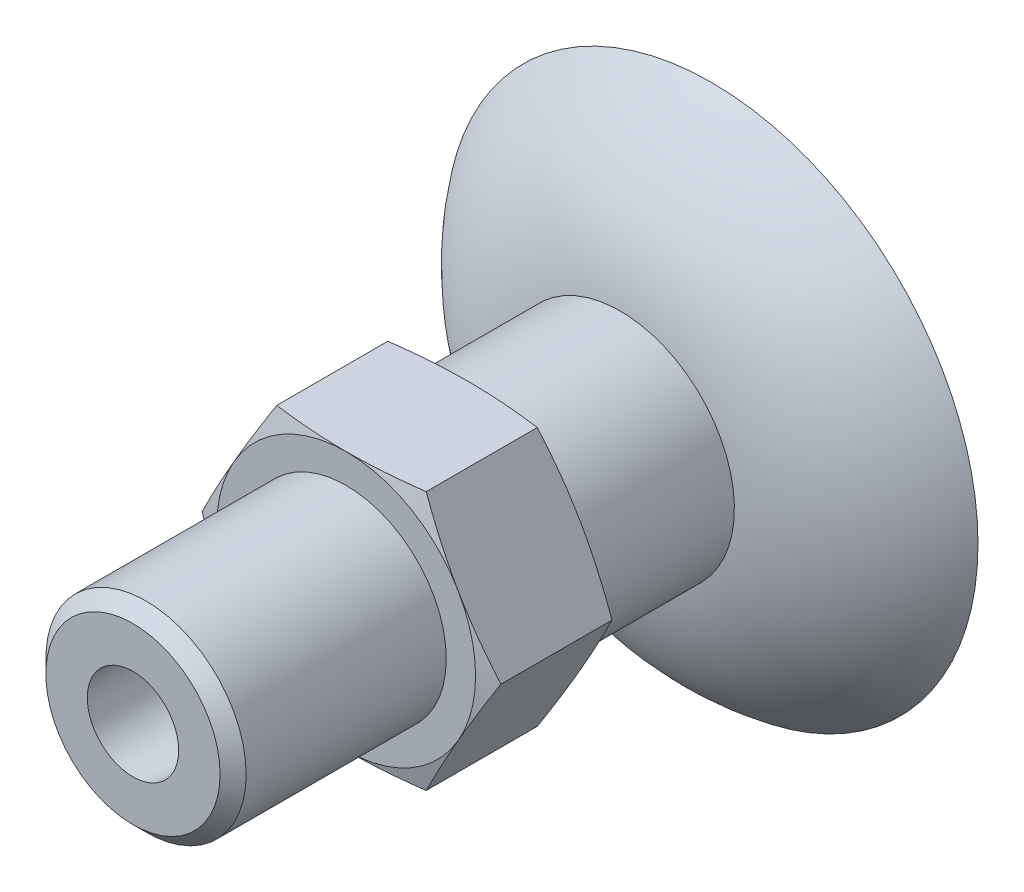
ISO-10303-21;
HEADER;
FILE_DESCRIPTION(('STEP AP214'),'2;1');
FILE_NAME('part.step','',(''),(''),'','','');
FILE_SCHEMA(('AUTOMOTIVE_DESIGN { 1 0 10303 214 1 1 1 1 }'));
ENDSEC;
DATA;
#1=APPLICATION_CONTEXT('core data for automotive mechanical design processes');
#2=APPLICATION_PROTOCOL_DEFINITION('international standard','automotive_design',2000,#1);
#3=PRODUCT_CONTEXT('',#1,'mechanical');
#4=PRODUCT('Part','Part','',(#3));
#5=PRODUCT_RELATED_PRODUCT_CATEGORY('part','',(#4));
#6=PRODUCT_DEFINITION_FORMATION('','',#4);
#7=PRODUCT_DEFINITION_CONTEXT('part definition',#1,'design');
#8=PRODUCT_DEFINITION('design','',#6,#7);
#9=PRODUCT_DEFINITION_SHAPE('','',#8);
#10=(LENGTH_UNIT() NAMED_UNIT(*) SI_UNIT(.MILLI.,.METRE.));
#11=(NAMED_UNIT(*) PLANE_ANGLE_UNIT() SI_UNIT($,.RADIAN.));
#12=(NAMED_UNIT(*) SI_UNIT($,.STERADIAN.) SOLID_ANGLE_UNIT());
#13=UNCERTAINTY_MEASURE_WITH_UNIT(LENGTH_MEASURE(1.E-05),#10,'distance_accuracy_value','');
#14=(GEOMETRIC_REPRESENTATION_CONTEXT(3) GLOBAL_UNCERTAINTY_ASSIGNED_CONTEXT((#13)) GLOBAL_UNIT_ASSIGNED_CONTEXT((#10,
#11,#12)) REPRESENTATION_CONTEXT('',''));
#15=CARTESIAN_POINT('',(0.,0.,0.));
#16=DIRECTION('',(0.,0.,1.));
#17=DIRECTION('',(1.,0.,0.));
#18=AXIS2_PLACEMENT_3D('',#15,#16,#17);
#19=CARTESIAN_POINT('',(9.81495457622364,0.,16.));
#20=DIRECTION('',(0.866025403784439,0.5,0.));
#21=DIRECTION('',(0.,0.,1.));
#22=AXIS2_PLACEMENT_3D('',#19,#20,#21);
#23=PLANE('',#22);
#24=DIRECTION('',(0.,0.,1.));
#25=VECTOR('',#24,1.);
#26=CARTESIAN_POINT('',(4.90747728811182,8.5,16.));
#27=LINE('',#26,#25);
#28=CARTESIAN_POINT('',(4.90747728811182,8.5,16.3523410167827));
#29=VERTEX_POINT('',#28);
#30=CARTESIAN_POINT('',(4.90747728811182,8.5,23.6476589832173));
#31=VERTEX_POINT('',#30);
#32=EDGE_CURVE('E114',#29,#31,#27,.T.);
#33=ORIENTED_EDGE('',*,*,#32,.T.);
#34=CARTESIAN_POINT('',(7.36121593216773,4.25000000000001,24.));
#35=CARTESIAN_POINT('',(7.25906175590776,4.42681371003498,24.0000283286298));
#36=CARTESIAN_POINT('',(7.15683049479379,4.60358298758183,23.9980853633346));
#37=CARTESIAN_POINT('',(6.95297562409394,4.95616774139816,23.9903015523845));
#38=CARTESIAN_POINT('',(6.85135160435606,5.1319834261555,23.9844809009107));
#39=CARTESIAN_POINT('',(6.64789890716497,5.4845122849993,23.9689468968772));
#40=CARTESIAN_POINT('',(6.54607179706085,5.66122549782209,23.9592139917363));
#41=CARTESIAN_POINT('',(6.34102365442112,6.01708320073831,23.9359159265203));
#42=CARTESIAN_POINT('',(6.23780425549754,6.19622503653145,23.92229626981));
#43=CARTESIAN_POINT('',(6.03399427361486,6.54934217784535,23.8919827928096));
#44=CARTESIAN_POINT('',(5.93340724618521,6.72332747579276,23.8753809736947));
#45=CARTESIAN_POINT('',(5.73149806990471,7.07269913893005,23.8388368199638));
#46=CARTESIAN_POINT('',(5.63017779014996,7.24808347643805,23.8188648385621));
#47=CARTESIAN_POINT('',(5.42622044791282,7.60127476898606,23.7756107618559));
#48=CARTESIAN_POINT('',(5.32358676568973,7.77907804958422,23.7522829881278));
#49=CARTESIAN_POINT('',(5.11643524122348,8.13798036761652,23.7023308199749));
#50=CARTESIAN_POINT('',(5.01192109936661,8.3190736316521,23.6756494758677));
#51=CARTESIAN_POINT('',(4.90747728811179,8.49999999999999,23.6476589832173));
#52=B_SPLINE_CURVE_WITH_KNOTS('',3,(#34,#35,#36,#37,#38,#39,#40,#41,#42,#43,#44,#45,#46,#47,#48,
#49,#50,#51),.UNSPECIFIED.,.F.,.F.,(4,2,2,2,2,2,2,2,4),(0.,0.612597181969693,1.22202876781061,
1.83454479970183,2.45611071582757,3.0610462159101,3.67161078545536,4.29145119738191,
4.92377991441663),.UNSPECIFIED.);
#53=CARTESIAN_POINT('',(7.36121593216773,4.25,24.));
#54=VERTEX_POINT('',#53);
#55=EDGE_CURVE('E532',#54,#31,#52,.T.);
#56=ORIENTED_EDGE('',*,*,#55,.F.);
#57=CARTESIAN_POINT('',(9.81495457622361,0.,23.6476589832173));
#58=CARTESIAN_POINT('',(9.71049903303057,0.180898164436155,23.6756469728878));
#59=CARTESIAN_POINT('',(9.60593547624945,0.36194148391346,23.7023256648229));
#60=CARTESIAN_POINT('',(9.39870838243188,0.720772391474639,23.7522744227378));
#61=CARTESIAN_POINT('',(9.29604797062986,0.898553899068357,23.7756012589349));
#62=CARTESIAN_POINT('',(9.09215663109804,1.25178452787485,23.8188552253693));
#63=CARTESIAN_POINT('',(8.9909272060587,1.42722891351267,23.8388278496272));
#64=CARTESIAN_POINT('',(8.78930184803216,1.77679219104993,23.875375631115));
#65=CARTESIAN_POINT('',(8.68890677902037,1.95090849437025,23.8919802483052));
#66=CARTESIAN_POINT('',(8.48499517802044,2.30396626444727,23.9222962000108));
#67=CARTESIAN_POINT('',(8.38146828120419,2.48290963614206,23.9359161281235));
#68=CARTESIAN_POINT('',(8.1758194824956,2.83839265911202,23.9592144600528));
#69=CARTESIAN_POINT('',(8.07369897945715,3.01492953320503,23.9689471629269));
#70=CARTESIAN_POINT('',(7.87012962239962,3.36739105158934,23.9844810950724));
#71=CARTESIAN_POINT('',(7.7686799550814,3.54331437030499,23.9903016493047));
#72=CARTESIAN_POINT('',(7.56525161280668,3.89617326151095,23.9980854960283));
#73=CARTESIAN_POINT('',(7.46327295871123,4.07310929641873,24.0000283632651));
#74=CARTESIAN_POINT('',(7.36121593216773,4.25000000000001,24.));
#75=B_SPLINE_CURVE_WITH_KNOTS('',3,(#57,#58,#59,#60,#61,#62,#63,#64,#65,#66,#67,#68,#69,#70,#71,
#72,#73,#74),.UNSPECIFIED.,.F.,.F.,(4,2,2,2,2,2,2,2,4),(0.,0.632272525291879,1.25209624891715,
1.86268065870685,2.46766909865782,3.08918081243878,3.70167875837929,4.31112844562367,
4.92377995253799),.UNSPECIFIED.);
#76=CARTESIAN_POINT('',(9.81495457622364,0.,23.6476589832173));
#77=VERTEX_POINT('',#76);
#78=EDGE_CURVE('E510',#77,#54,#75,.T.);
#79=ORIENTED_EDGE('',*,*,#78,.F.);
#80=DIRECTION('',(0.,0.,1.));
#81=VECTOR('',#80,1.);
#82=CARTESIAN_POINT('',(9.81495457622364,0.,16.));
#83=LINE('',#82,#81);
#84=CARTESIAN_POINT('',(9.81495457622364,0.,16.3523410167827));
#85=VERTEX_POINT('',#84);
#86=EDGE_CURVE('E105',#85,#77,#83,.T.);
#87=ORIENTED_EDGE('',*,*,#86,.F.);
#88=CARTESIAN_POINT('',(7.36121593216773,4.25000000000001,16.));
#89=CARTESIAN_POINT('',(7.46326400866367,4.07312503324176,15.9999716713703));
#90=CARTESIAN_POINT('',(7.56523506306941,3.8962055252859,16.0019146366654));
#91=CARTESIAN_POINT('',(7.76865498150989,3.54336965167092,16.0096984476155));
#92=CARTESIAN_POINT('',(7.8701038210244,3.36745282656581,16.0155190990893));
#93=CARTESIAN_POINT('',(8.07367641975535,3.01499319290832,16.0310531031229));
#94=CARTESIAN_POINT('',(8.17580099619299,2.83845172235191,16.0407860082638));
#95=CARTESIAN_POINT('',(8.38145873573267,2.48294597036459,16.0640840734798));
#96=CARTESIAN_POINT('',(8.48499041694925,2.30398443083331,16.07770373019));
#97=CARTESIAN_POINT('',(8.6888938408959,1.95092123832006,16.1080172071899));
#98=CARTESIAN_POINT('',(8.78927601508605,1.77681766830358,16.1246190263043));
#99=CARTESIAN_POINT('',(8.99088616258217,1.42727336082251,16.1611631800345));
#100=CARTESIAN_POINT('',(9.09211331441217,1.25183525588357,16.1811351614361));
#101=CARTESIAN_POINT('',(9.29600727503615,0.898607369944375,16.2243892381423));
#102=CARTESIAN_POINT('',(9.39867259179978,0.72082235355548,16.2477170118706));
#103=CARTESIAN_POINT('',(9.60591535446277,0.361972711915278,16.2976691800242));
#104=CARTESIAN_POINT('',(9.71048965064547,0.180914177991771,16.3243505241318));
#105=CARTESIAN_POINT('',(9.81495457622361,0.,16.3523410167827));
#106=B_SPLINE_CURVE_WITH_KNOTS('',3,(#88,#89,#90,#91,#92,#93,#94,#95,#96,#97,#98,#99,#100,#101,
#102,#103,#104,#105),.UNSPECIFIED.,.F.,.F.,(4,2,2,2,2,2,2,2,4),(0.,0.612597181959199,
1.22202876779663,1.83454479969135,2.45611071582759,3.06104621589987,3.67161078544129,
4.29145119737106,4.92377991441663),.UNSPECIFIED.);
#107=CARTESIAN_POINT('',(7.36121593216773,4.25,16.));
#108=VERTEX_POINT('',#107);
#109=EDGE_CURVE('E702',#108,#85,#106,.T.);
#110=ORIENTED_EDGE('',*,*,#109,.F.);
#111=CARTESIAN_POINT('',(4.90747728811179,8.49999999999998,16.3523410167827));
#112=CARTESIAN_POINT('',(5.01191192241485,8.31908976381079,16.3243530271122));
#113=CARTESIAN_POINT('',(5.11641825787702,8.1380134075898,16.2976743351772));
#114=CARTESIAN_POINT('',(5.32356139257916,7.77913402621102,16.2477255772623));
#115=CARTESIAN_POINT('',(5.4261944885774,7.6013367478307,16.2243987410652));
#116=CARTESIAN_POINT('',(5.63015551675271,7.24814635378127,16.1811447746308));
#117=CARTESIAN_POINT('',(5.73148009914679,7.07275690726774,16.1611721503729));
#118=CARTESIAN_POINT('',(5.93339809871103,6.72336258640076,16.1246243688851));
#119=CARTESIAN_POINT('',(6.03398970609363,6.5493597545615,16.1080197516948));
#120=CARTESIAN_POINT('',(6.23779090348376,6.19623824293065,16.0777037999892));
#121=CARTESIAN_POINT('',(6.34099696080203,6.01710963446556,16.0640838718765));
#122=CARTESIAN_POINT('',(6.54602988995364,5.66127103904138,16.0407855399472));
#123=CARTESIAN_POINT('',(6.64785505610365,5.48456365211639,16.0310528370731));
#124=CARTESIAN_POINT('',(6.85131100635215,5.13203665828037,16.0155189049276));
#125=CARTESIAN_POINT('',(6.95294023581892,4.95621700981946,16.0096983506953));
#126=CARTESIAN_POINT('',(7.15681082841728,4.60361345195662,16.0019145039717));
#127=CARTESIAN_POINT('',(7.2590526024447,4.42682932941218,15.9999716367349));
#128=CARTESIAN_POINT('',(7.36121593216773,4.25000000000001,16.));
#129=B_SPLINE_CURVE_WITH_KNOTS('',3,(#111,#112,#113,#114,#115,#116,#117,#118,#119,#120,#121,
#122,#123,#124,#125,#126,#127,#128),.UNSPECIFIED.,.F.,.F.,(4,2,2,2,2,2,2,2,4),(0.,
0.632272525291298,1.25209624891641,1.86268065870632,2.46766909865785,3.08918081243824,
3.70167875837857,4.31112844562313,4.92377995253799),.UNSPECIFIED.);
#130=EDGE_CURVE('E195',#29,#108,#129,.T.);
#131=ORIENTED_EDGE('',*,*,#130,.F.);
#132=EDGE_LOOP('',(#33,#56,#79,#87,#110,#131));
#133=FACE_BOUND('',#132,.T.);
#134=ADVANCED_FACE('F16',(#133),#23,.T.);
#135=CARTESIAN_POINT('',(4.90747728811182,8.5,16.));
#136=DIRECTION('',(0.,1.,0.));
#137=DIRECTION('',(-1.,0.,0.));
#138=AXIS2_PLACEMENT_3D('',#135,#136,#137);
#139=PLANE('',#138);
#140=DIRECTION('',(0.,0.,1.));
#141=VECTOR('',#140,1.);
#142=CARTESIAN_POINT('',(-4.90747728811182,8.5,16.));
#143=LINE('',#142,#141);
#144=CARTESIAN_POINT('',(-4.90747728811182,8.5,16.3523410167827));
#145=VERTEX_POINT('',#144);
#146=CARTESIAN_POINT('',(-4.90747728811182,8.5,23.6476589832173));
#147=VERTEX_POINT('',#146);
#148=EDGE_CURVE('E316',#145,#147,#143,.T.);
#149=ORIENTED_EDGE('',*,*,#148,.T.);
#150=CARTESIAN_POINT('',(0.,8.50000000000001,24.));
#151=CARTESIAN_POINT('',(-0.204176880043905,8.49993864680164,24.000028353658));
#152=CARTESIAN_POINT('',(-0.408353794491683,8.4997949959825,23.9980841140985));
#153=CARTESIAN_POINT('',(-0.815609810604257,8.49956334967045,23.9902964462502));
#154=CARTESIAN_POINT('',(-1.01868928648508,8.49947507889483,23.9844726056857));
#155=CARTESIAN_POINT('',(-1.42576127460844,8.49956968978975,23.9689308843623));
#156=CARTESIAN_POINT('',(-1.6297530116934,8.49975399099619,23.959192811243));
#157=CARTESIAN_POINT('',(-2.04057387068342,8.50012267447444,23.9358833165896));
#158=CARTESIAN_POINT('',(-2.24739984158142,8.50030701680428,23.9222567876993));
#159=CARTESIAN_POINT('',(-2.65519984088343,8.50035684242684,23.8919349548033));
#160=CARTESIAN_POINT('',(-2.85618081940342,8.50023081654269,23.8753326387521));
#161=CARTESIAN_POINT('',(-3.2597010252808,8.50003909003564,23.8387900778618));
#162=CARTESIAN_POINT('',(-3.46223759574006,8.49997395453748,23.8188205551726));
#163=CARTESIAN_POINT('',(-3.87004259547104,8.49991499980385,23.775574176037));
#164=CARTESIAN_POINT('',(-4.07530619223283,8.49992227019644,23.752252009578));
#165=CARTESIAN_POINT('',(-4.48960341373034,8.49995838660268,23.7023138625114));
#166=CARTESIAN_POINT('',(-4.69863023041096,8.49998766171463,23.6756412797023));
#167=CARTESIAN_POINT('',(-4.90747728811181,8.5,23.6476589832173));
#168=B_SPLINE_CURVE_WITH_KNOTS('',3,(#150,#151,#152,#153,#154,#155,#156,#157,#158,#159,#160,
#161,#162,#163,#164,#165,#166,#167),.UNSPECIFIED.,.F.,.F.,(4,2,2,2,2,2,2,2,4),(0.,
0.612521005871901,1.22197265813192,1.83460948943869,2.4564009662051,3.06137183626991,
3.67190327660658,4.29163625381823,4.92377827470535),.UNSPECIFIED.);
#169=CARTESIAN_POINT('',(0.,8.5,24.));
#170=VERTEX_POINT('',#169);
#171=EDGE_CURVE('E280',#170,#147,#168,.T.);
#172=ORIENTED_EDGE('',*,*,#171,.F.);
#173=CARTESIAN_POINT('',(4.9074772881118,8.50000000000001,23.6476589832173));
#174=CARTESIAN_POINT('',(4.69946398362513,8.49998809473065,23.6755294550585));
#175=CARTESIAN_POINT('',(4.49127255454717,8.49995395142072,23.7021019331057));
#176=CARTESIAN_POINT('',(4.07863628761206,8.49990114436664,23.751867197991));
#177=CARTESIAN_POINT('',(3.87419820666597,8.49988218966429,23.7751161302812));
#178=CARTESIAN_POINT('',(3.46804768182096,8.49991440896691,23.8182431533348));
#179=CARTESIAN_POINT('',(3.26634005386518,8.49996454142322,23.8381663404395));
#180=CARTESIAN_POINT('',(2.86449662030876,8.50012588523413,23.8746436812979));
#181=CARTESIAN_POINT('',(2.6643634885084,8.50023652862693,23.8912272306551));
#182=CARTESIAN_POINT('',(2.25663453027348,8.50017221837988,23.9216619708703));
#183=CARTESIAN_POINT('',(2.04902969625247,8.49998682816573,23.9353931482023));
#184=CARTESIAN_POINT('',(1.63662828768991,8.49963276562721,23.9588816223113));
#185=CARTESIAN_POINT('',(1.43183486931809,8.49946388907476,23.9686939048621));
#186=CARTESIAN_POINT('',(1.02311579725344,8.49940595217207,23.9843546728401));
#187=CARTESIAN_POINT('',(0.819190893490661,8.49951550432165,23.9902226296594));
#188=CARTESIAN_POINT('',(0.410177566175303,8.49978124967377,23.9980701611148));
#189=CARTESIAN_POINT('',(0.205088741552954,8.49993768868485,24.0000288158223));
#190=CARTESIAN_POINT('',(0.,8.50000000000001,24.));
#191=B_SPLINE_CURVE_WITH_KNOTS('',3,(#173,#174,#175,#176,#177,#178,#179,#180,#181,#182,#183,
#184,#185,#186,#187,#188,#189,#190),.UNSPECIFIED.,.F.,.F.,(4,2,2,2,2,2,2,2,4),(0.,
0.629618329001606,1.2468660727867,1.8549093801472,2.45734110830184,3.08148436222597,
3.69653362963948,4.30852392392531,4.92378048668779),.UNSPECIFIED.);
#192=EDGE_CURVE('E564',#31,#170,#191,.T.);
#193=ORIENTED_EDGE('',*,*,#192,.F.);
#194=ORIENTED_EDGE('',*,*,#32,.F.);
#195=CARTESIAN_POINT('',(0.,8.5,16.));
#196=CARTESIAN_POINT('',(0.204176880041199,8.49993864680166,15.999971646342));
#197=CARTESIAN_POINT('',(0.408353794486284,8.49979499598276,16.0019158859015));
#198=CARTESIAN_POINT('',(0.81560981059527,8.49956334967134,16.0097035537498));
#199=CARTESIAN_POINT('',(1.0186892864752,8.4994750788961,16.0155273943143));
#200=CARTESIAN_POINT('',(1.42576127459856,8.49956968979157,16.0310691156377));
#201=CARTESIAN_POINT('',(1.62975301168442,8.4997539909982,16.0408071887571));
#202=CARTESIAN_POINT('',(2.04057387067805,8.5001226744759,16.0641166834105));
#203=CARTESIAN_POINT('',(2.24739984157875,8.500307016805,16.0777432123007));
#204=CARTESIAN_POINT('',(2.65519984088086,8.50035684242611,16.1080650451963));
#205=CARTESIAN_POINT('',(2.85618081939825,8.50023081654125,16.1246673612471));
#206=CARTESIAN_POINT('',(3.25970102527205,8.50003909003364,16.1612099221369));
#207=CARTESIAN_POINT('',(3.46223759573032,8.49997395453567,16.181179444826));
#208=CARTESIAN_POINT('',(3.87004259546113,8.49991499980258,16.2244258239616));
#209=CARTESIAN_POINT('',(4.07530619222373,8.49992227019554,16.2477479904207));
#210=CARTESIAN_POINT('',(4.48960341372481,8.49995838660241,16.2976861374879));
#211=CARTESIAN_POINT('',(4.69863023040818,8.49998766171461,16.3243587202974));
#212=CARTESIAN_POINT('',(4.9074772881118,8.50000000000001,16.3523410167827));
#213=B_SPLINE_CURVE_WITH_KNOTS('',3,(#195,#196,#197,#198,#199,#200,#201,#202,#203,#204,#205,
#206,#207,#208,#209,#210,#211,#212),.UNSPECIFIED.,.F.,.F.,(4,2,2,2,2,2,2,2,4),(0.,
0.612521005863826,1.22197265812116,1.83460948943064,2.45640096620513,3.06137183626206,
3.67190327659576,4.29163625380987,4.92377827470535),.UNSPECIFIED.);
#214=CARTESIAN_POINT('',(0.,8.5,16.));
#215=VERTEX_POINT('',#214);
#216=EDGE_CURVE('E204',#215,#29,#213,.T.);
#217=ORIENTED_EDGE('',*,*,#216,.F.);
#218=CARTESIAN_POINT('',(-4.90747728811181,8.49999999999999,16.3523410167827));
#219=CARTESIAN_POINT('',(-4.6994639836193,8.4999880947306,16.3244705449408));
#220=CARTESIAN_POINT('',(-4.49127255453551,8.49995395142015,16.2978980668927));
#221=CARTESIAN_POINT('',(-4.07863628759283,8.49990114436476,16.2481328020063));
#222=CARTESIAN_POINT('',(-3.87419820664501,8.49988218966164,16.2248838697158));
#223=CARTESIAN_POINT('',(-3.46804768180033,8.49991440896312,16.1817568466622));
#224=CARTESIAN_POINT('',(-3.26634005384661,8.49996454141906,16.1618336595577));
#225=CARTESIAN_POINT('',(-2.86449662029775,8.50012588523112,16.1253563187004));
#226=CARTESIAN_POINT('',(-2.66436348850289,8.50023652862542,16.1087727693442));
#227=CARTESIAN_POINT('',(-2.25663453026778,8.50017221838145,16.0783380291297));
#228=CARTESIAN_POINT('',(-2.04902969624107,8.49998682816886,16.0646068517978));
#229=CARTESIAN_POINT('',(-1.63662828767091,8.49963276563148,16.0411183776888));
#230=CARTESIAN_POINT('',(-1.4318348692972,8.49946388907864,16.0313060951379));
#231=CARTESIAN_POINT('',(-1.02311579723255,8.49940595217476,16.01564532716));
#232=CARTESIAN_POINT('',(-0.819190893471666,8.49951550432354,16.0097773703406));
#233=CARTESIAN_POINT('',(-0.410177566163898,8.49978124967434,16.0019298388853));
#234=CARTESIAN_POINT('',(-0.205088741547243,8.49993768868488,15.9999711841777));
#235=CARTESIAN_POINT('',(0.,8.5,16.));
#236=B_SPLINE_CURVE_WITH_KNOTS('',3,(#218,#219,#220,#221,#222,#223,#224,#225,#226,#227,#228,
#229,#230,#231,#232,#233,#234,#235),.UNSPECIFIED.,.F.,.F.,(4,2,2,2,2,2,2,2,4),(0.,
0.629618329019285,1.24686607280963,1.8549093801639,2.45734110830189,3.08148436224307,
3.69653362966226,4.30852392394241,4.9237804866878),.UNSPECIFIED.);
#237=EDGE_CURVE('E685',#145,#215,#236,.T.);
#238=ORIENTED_EDGE('',*,*,#237,.F.);
#239=EDGE_LOOP('',(#149,#172,#193,#194,#217,#238));
#240=FACE_BOUND('',#239,.T.);
#241=ADVANCED_FACE('F462',(#240),#139,.T.);
#242=CARTESIAN_POINT('',(-4.90747728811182,8.5,16.));
#243=DIRECTION('',(-0.866025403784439,0.5,0.));
#244=DIRECTION('',(0.,0.,-1.));
#245=AXIS2_PLACEMENT_3D('',#242,#243,#244);
#246=PLANE('',#245);
#247=DIRECTION('',(0.,0.,1.));
#248=VECTOR('',#247,1.);
#249=CARTESIAN_POINT('',(-9.81495457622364,0.,16.));
#250=LINE('',#249,#248);
#251=CARTESIAN_POINT('',(-9.81495457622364,0.,16.3523410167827));
#252=VERTEX_POINT('',#251);
#253=CARTESIAN_POINT('',(-9.81495457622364,0.,23.6476589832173));
#254=VERTEX_POINT('',#253);
#255=EDGE_CURVE('E263',#252,#254,#250,.T.);
#256=ORIENTED_EDGE('',*,*,#255,.T.);
#257=CARTESIAN_POINT('',(-7.36121593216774,4.25,24.));
#258=CARTESIAN_POINT('',(-7.46326400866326,4.07312503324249,24.0000283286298));
#259=CARTESIAN_POINT('',(-7.56523506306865,3.89620552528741,23.9980853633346));
#260=CARTESIAN_POINT('',(-7.76865498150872,3.54336965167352,23.9903015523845));
#261=CARTESIAN_POINT('',(-7.8701038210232,3.36745282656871,23.9844809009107));
#262=CARTESIAN_POINT('',(-8.0736764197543,3.01499319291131,23.9689468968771));
#263=CARTESIAN_POINT('',(-8.17580099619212,2.83845172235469,23.9592139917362));
#264=CARTESIAN_POINT('',(-8.38145873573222,2.48294597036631,23.9359159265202));
#265=CARTESIAN_POINT('',(-8.48499041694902,2.30398443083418,23.9222962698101));
#266=CARTESIAN_POINT('',(-8.68889384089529,1.95092123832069,23.8919827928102));
#267=CARTESIAN_POINT('',(-8.78927601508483,1.77681766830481,23.875380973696));
#268=CARTESIAN_POINT('',(-8.99088616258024,1.42727336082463,23.838836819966));
#269=CARTESIAN_POINT('',(-9.09211331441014,1.25183525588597,23.8188648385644));
#270=CARTESIAN_POINT('',(-9.29600727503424,0.898607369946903,23.7756107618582));
#271=CARTESIAN_POINT('',(-9.3986725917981,0.720822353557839,23.7522829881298));
#272=CARTESIAN_POINT('',(-9.60591535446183,0.361972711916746,23.7023308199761));
#273=CARTESIAN_POINT('',(-9.71048965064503,0.180914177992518,23.6756494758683));
#274=CARTESIAN_POINT('',(-9.81495457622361,0.,23.6476589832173));
#275=B_SPLINE_CURVE_WITH_KNOTS('',3,(#257,#258,#259,#260,#261,#262,#263,#264,#265,#266,#267,
#268,#269,#270,#271,#272,#273,#274),.UNSPECIFIED.,.F.,.F.,(4,2,2,2,2,2,2,2,4),(0.,
0.612597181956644,1.22202876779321,1.83454479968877,2.45611071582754,3.06104621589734,
3.67161078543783,4.2914511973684,4.92377991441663),.UNSPECIFIED.);
#276=CARTESIAN_POINT('',(-7.36121593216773,4.25,24.));
#277=VERTEX_POINT('',#276);
#278=EDGE_CURVE('E250',#277,#254,#275,.T.);
#279=ORIENTED_EDGE('',*,*,#278,.F.);
#280=CARTESIAN_POINT('',(-4.9074772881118,8.49999999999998,23.6476589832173));
#281=CARTESIAN_POINT('',(-5.01191192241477,8.31908976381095,23.6756469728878));
#282=CARTESIAN_POINT('',(-5.11641825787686,8.13801340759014,23.7023256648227));
#283=CARTESIAN_POINT('',(-5.32356139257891,7.77913402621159,23.7522744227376));
#284=CARTESIAN_POINT('',(-5.42619448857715,7.60133674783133,23.7756012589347));
#285=CARTESIAN_POINT('',(-5.63015551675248,7.24814635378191,23.8188552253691));
#286=CARTESIAN_POINT('',(-5.73148009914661,7.07275690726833,23.838827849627));
#287=CARTESIAN_POINT('',(-5.93339809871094,6.72336258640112,23.8753756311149));
#288=CARTESIAN_POINT('',(-6.03398970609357,6.5493597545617,23.8919802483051));
#289=CARTESIAN_POINT('',(-6.23779090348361,6.1962382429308,23.9222962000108));
#290=CARTESIAN_POINT('',(-6.34099696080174,6.01710963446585,23.9359161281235));
#291=CARTESIAN_POINT('',(-6.5460298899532,5.66127103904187,23.9592144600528));
#292=CARTESIAN_POINT('',(-6.64785505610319,5.48456365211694,23.9689471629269));
#293=CARTESIAN_POINT('',(-6.85131100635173,5.13203665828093,23.9844810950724));
#294=CARTESIAN_POINT('',(-6.95294023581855,4.95621700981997,23.9903016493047));
#295=CARTESIAN_POINT('',(-7.15681082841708,4.60361345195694,23.9980854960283));
#296=CARTESIAN_POINT('',(-7.25905260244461,4.42682932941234,24.0000283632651));
#297=CARTESIAN_POINT('',(-7.36121593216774,4.25,24.));
#298=B_SPLINE_CURVE_WITH_KNOTS('',3,(#280,#281,#282,#283,#284,#285,#286,#287,#288,#289,#290,
#291,#292,#293,#294,#295,#296,#297),.UNSPECIFIED.,.F.,.F.,(4,2,2,2,2,2,2,2,4),(0.,
0.632272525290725,1.25209624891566,1.86268065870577,2.46766909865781,3.08918081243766,
3.7016787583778,4.31112844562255,4.92377995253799),.UNSPECIFIED.);
#299=EDGE_CURVE('E259',#147,#277,#298,.T.);
#300=ORIENTED_EDGE('',*,*,#299,.F.);
#301=ORIENTED_EDGE('',*,*,#148,.F.);
#302=CARTESIAN_POINT('',(-7.36121593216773,4.25,16.));
#303=CARTESIAN_POINT('',(-7.25906175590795,4.42681371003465,15.9999716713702));
#304=CARTESIAN_POINT('',(-7.15683049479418,4.6035829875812,16.0019146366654));
#305=CARTESIAN_POINT('',(-6.95297562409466,4.95616774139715,16.0096984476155));
#306=CARTESIAN_POINT('',(-6.85135160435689,5.13198342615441,16.0155190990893));
#307=CARTESIAN_POINT('',(-6.64789890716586,5.48451228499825,16.0310531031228));
#308=CARTESIAN_POINT('',(-6.5460717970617,5.66122549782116,16.0407860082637));
#309=CARTESIAN_POINT('',(-6.34102365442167,6.01708320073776,16.0640840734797));
#310=CARTESIAN_POINT('',(-6.23780425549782,6.19622503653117,16.07770373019));
#311=CARTESIAN_POINT('',(-6.03399427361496,6.54934217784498,16.1080172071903));
#312=CARTESIAN_POINT('',(-5.93340724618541,6.72332747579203,16.1246190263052));
#313=CARTESIAN_POINT('',(-5.73149806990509,7.07269913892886,16.161163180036));
#314=CARTESIAN_POINT('',(-5.63017779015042,7.24808347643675,16.1811351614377));
#315=CARTESIAN_POINT('',(-5.42622044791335,7.60127476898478,16.2243892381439));
#316=CARTESIAN_POINT('',(-5.32358676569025,7.77907804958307,16.247717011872));
#317=CARTESIAN_POINT('',(-5.11643524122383,8.13798036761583,16.297669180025));
#318=CARTESIAN_POINT('',(-5.0119210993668,8.31907363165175,16.3243505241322));
#319=CARTESIAN_POINT('',(-4.9074772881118,8.49999999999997,16.3523410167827));
#320=B_SPLINE_CURVE_WITH_KNOTS('',3,(#302,#303,#304,#305,#306,#307,#308,#309,#310,#311,#312,
#313,#314,#315,#316,#317,#318,#319),.UNSPECIFIED.,.F.,.F.,(4,2,2,2,2,2,2,2,4),(0.,
0.612597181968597,1.22202876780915,1.83454479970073,2.45611071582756,3.06104621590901,
3.67161078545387,4.29145119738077,4.92377991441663),.UNSPECIFIED.);
#321=CARTESIAN_POINT('',(-7.36121593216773,4.25,16.));
#322=VERTEX_POINT('',#321);
#323=EDGE_CURVE('E669',#322,#145,#320,.T.);
#324=ORIENTED_EDGE('',*,*,#323,.F.);
#325=CARTESIAN_POINT('',(-9.81495457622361,0.,16.3523410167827));
#326=CARTESIAN_POINT('',(-9.71049903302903,0.18089816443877,16.3243530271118));
#327=CARTESIAN_POINT('',(-9.60593547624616,0.361941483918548,16.2976743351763));
#328=CARTESIAN_POINT('',(-9.39870838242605,0.720772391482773,16.2477255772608));
#329=CARTESIAN_POINT('',(-9.29604797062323,0.898553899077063,16.2243987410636));
#330=CARTESIAN_POINT('',(-9.09215663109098,1.25178452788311,16.1811447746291));
#331=CARTESIAN_POINT('',(-8.99092720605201,1.42722891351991,16.1611721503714));
#332=CARTESIAN_POINT('',(-8.78930184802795,1.77679219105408,16.1246243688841));
#333=CARTESIAN_POINT('',(-8.68890677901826,1.95090849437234,16.1080197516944));
#334=CARTESIAN_POINT('',(-8.48499517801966,2.30396626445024,16.0777037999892));
#335=CARTESIAN_POINT('',(-8.38146828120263,2.48290963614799,16.0640838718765));
#336=CARTESIAN_POINT('',(-8.17581948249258,2.83839265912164,16.0407855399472));
#337=CARTESIAN_POINT('',(-8.07369897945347,3.0149295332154,16.0310528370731));
#338=CARTESIAN_POINT('',(-7.87012962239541,3.3673910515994,16.0155189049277));
#339=CARTESIAN_POINT('',(-7.76867995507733,3.54331437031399,16.0096983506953));
#340=CARTESIAN_POINT('',(-7.56525161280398,3.8961732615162,16.0019145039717));
#341=CARTESIAN_POINT('',(-7.46327295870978,4.07310929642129,15.9999716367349));
#342=CARTESIAN_POINT('',(-7.36121593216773,4.25,16.));
#343=B_SPLINE_CURVE_WITH_KNOTS('',3,(#325,#326,#327,#328,#329,#330,#331,#332,#333,#334,#335,
#336,#337,#338,#339,#340,#341,#342),.UNSPECIFIED.,.F.,.F.,(4,2,2,2,2,2,2,2,4),(0.,
0.632272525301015,1.25209624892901,1.86268065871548,2.46766909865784,3.08918081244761,
3.70167875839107,4.3111284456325,4.92377995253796),.UNSPECIFIED.);
#344=EDGE_CURVE('E670',#252,#322,#343,.T.);
#345=ORIENTED_EDGE('',*,*,#344,.F.);
#346=EDGE_LOOP('',(#256,#279,#300,#301,#324,#345));
#347=FACE_BOUND('',#346,.T.);
#348=ADVANCED_FACE('F233',(#347),#246,.T.);
#349=CARTESIAN_POINT('',(-9.81495457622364,0.,16.));
#350=DIRECTION('',(-0.866025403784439,-0.5,0.));
#351=DIRECTION('',(0.,0.,-1.));
#352=AXIS2_PLACEMENT_3D('',#349,#350,#351);
#353=PLANE('',#352);
#354=DIRECTION('',(0.,0.,1.));
#355=VECTOR('',#354,1.);
#356=CARTESIAN_POINT('',(-4.90747728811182,-8.5,16.));
#357=LINE('',#356,#355);
#358=CARTESIAN_POINT('',(-4.90747728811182,-8.5,16.3523410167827));
#359=VERTEX_POINT('',#358);
#360=CARTESIAN_POINT('',(-4.90747728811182,-8.5,23.6476589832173));
#361=VERTEX_POINT('',#360);
#362=EDGE_CURVE('E332',#359,#361,#357,.T.);
#363=ORIENTED_EDGE('',*,*,#362,.T.);
#364=CARTESIAN_POINT('',(-7.36121593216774,-4.25,24.));
#365=CARTESIAN_POINT('',(-7.25906175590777,-4.42681371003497,24.0000283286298));
#366=CARTESIAN_POINT('',(-7.15683049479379,-4.60358298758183,23.9980853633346));
#367=CARTESIAN_POINT('',(-6.95297562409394,-4.95616774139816,23.9903015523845));
#368=CARTESIAN_POINT('',(-6.85135160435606,-5.1319834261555,23.9844809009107));
#369=CARTESIAN_POINT('',(-6.64789890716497,-5.4845122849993,23.9689468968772));
#370=CARTESIAN_POINT('',(-6.54607179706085,-5.66122549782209,23.9592139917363));
#371=CARTESIAN_POINT('',(-6.34102365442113,-6.01708320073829,23.9359159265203));
#372=CARTESIAN_POINT('',(-6.23780425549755,-6.19622503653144,23.92229626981));
#373=CARTESIAN_POINT('',(-6.03399427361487,-6.54934217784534,23.8919827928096));
#374=CARTESIAN_POINT('',(-5.93340724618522,-6.72332747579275,23.8753809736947));
#375=CARTESIAN_POINT('',(-5.73149806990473,-7.07269913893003,23.8388368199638));
#376=CARTESIAN_POINT('',(-5.63017779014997,-7.24808347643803,23.8188648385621));
#377=CARTESIAN_POINT('',(-5.42622044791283,-7.60127476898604,23.7756107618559));
#378=CARTESIAN_POINT('',(-5.32358676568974,-7.77907804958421,23.7522829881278));
#379=CARTESIAN_POINT('',(-5.11643524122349,-8.13798036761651,23.7023308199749));
#380=CARTESIAN_POINT('',(-5.01192109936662,-8.31907363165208,23.6756494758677));
#381=CARTESIAN_POINT('',(-4.90747728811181,-8.49999999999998,23.6476589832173));
#382=B_SPLINE_CURVE_WITH_KNOTS('',3,(#364,#365,#366,#367,#368,#369,#370,#371,#372,#373,#374,
#375,#376,#377,#378,#379,#380,#381),.UNSPECIFIED.,.F.,.F.,(4,2,2,2,2,2,2,2,4),(0.,
0.612597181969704,1.22202876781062,1.83454479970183,2.45611071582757,3.06104621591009,
3.67161078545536,4.29145119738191,4.92377991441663),.UNSPECIFIED.);
#383=CARTESIAN_POINT('',(-7.36121593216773,-4.25,24.));
#384=VERTEX_POINT('',#383);
#385=EDGE_CURVE('E185',#384,#361,#382,.T.);
#386=ORIENTED_EDGE('',*,*,#385,.F.);
#387=CARTESIAN_POINT('',(-9.81495457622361,0.,23.6476589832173));
#388=CARTESIAN_POINT('',(-9.71049903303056,-0.180898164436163,23.6756469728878));
#389=CARTESIAN_POINT('',(-9.60593547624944,-0.361941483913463,23.7023256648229));
#390=CARTESIAN_POINT('',(-9.39870838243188,-0.720772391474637,23.7522744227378));
#391=CARTESIAN_POINT('',(-9.29604797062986,-0.898553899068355,23.7756012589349));
#392=CARTESIAN_POINT('',(-9.09215663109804,-1.25178452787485,23.8188552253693));
#393=CARTESIAN_POINT('',(-8.9909272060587,-1.42722891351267,23.8388278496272));
#394=CARTESIAN_POINT('',(-8.78930184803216,-1.77679219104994,23.875375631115));
#395=CARTESIAN_POINT('',(-8.68890677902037,-1.95090849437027,23.8919802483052));
#396=CARTESIAN_POINT('',(-8.48499517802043,-2.30396626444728,23.9222962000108));
#397=CARTESIAN_POINT('',(-8.38146828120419,-2.48290963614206,23.9359161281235));
#398=CARTESIAN_POINT('',(-8.1758194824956,-2.83839265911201,23.9592144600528));
#399=CARTESIAN_POINT('',(-8.07369897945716,-3.01492953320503,23.9689471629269));
#400=CARTESIAN_POINT('',(-7.87012962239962,-3.36739105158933,23.9844810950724));
#401=CARTESIAN_POINT('',(-7.76867995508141,-3.54331437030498,23.9903016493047));
#402=CARTESIAN_POINT('',(-7.56525161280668,-3.89617326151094,23.9980854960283));
#403=CARTESIAN_POINT('',(-7.46327295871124,-4.07310929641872,24.0000283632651));
#404=CARTESIAN_POINT('',(-7.36121593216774,-4.25,24.));
#405=B_SPLINE_CURVE_WITH_KNOTS('',3,(#387,#388,#389,#390,#391,#392,#393,#394,#395,#396,#397,
#398,#399,#400,#401,#402,#403,#404),.UNSPECIFIED.,.F.,.F.,(4,2,2,2,2,2,2,2,4),(0.,
0.632272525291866,1.25209624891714,1.86268065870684,2.46766909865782,3.08918081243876,
3.70167875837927,4.31112844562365,4.92377995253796),.UNSPECIFIED.);
#406=EDGE_CURVE('E177',#254,#384,#405,.T.);
#407=ORIENTED_EDGE('',*,*,#406,.F.);
#408=ORIENTED_EDGE('',*,*,#255,.F.);
#409=CARTESIAN_POINT('',(-7.36121593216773,-4.24999999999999,16.));
#410=CARTESIAN_POINT('',(-7.46326400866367,-4.07312503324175,15.9999716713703));
#411=CARTESIAN_POINT('',(-7.56523506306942,-3.89620552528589,16.0019146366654));
#412=CARTESIAN_POINT('',(-7.76865498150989,-3.54336965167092,16.0096984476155));
#413=CARTESIAN_POINT('',(-7.8701038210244,-3.36745282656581,16.0155190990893));
#414=CARTESIAN_POINT('',(-8.07367641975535,-3.01499319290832,16.0310531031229));
#415=CARTESIAN_POINT('',(-8.17580099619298,-2.83845172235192,16.0407860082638));
#416=CARTESIAN_POINT('',(-8.38145873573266,-2.4829459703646,16.0640840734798));
#417=CARTESIAN_POINT('',(-8.48499041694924,-2.30398443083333,16.07770373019));
#418=CARTESIAN_POINT('',(-8.6888938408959,-1.95092123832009,16.1080172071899));
#419=CARTESIAN_POINT('',(-8.78927601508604,-1.77681766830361,16.1246190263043));
#420=CARTESIAN_POINT('',(-8.99088616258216,-1.42727336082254,16.1611631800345));
#421=CARTESIAN_POINT('',(-9.09211331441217,-1.25183525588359,16.1811351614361));
#422=CARTESIAN_POINT('',(-9.29600727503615,-0.898607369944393,16.2243892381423));
#423=CARTESIAN_POINT('',(-9.39867259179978,-0.720822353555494,16.2477170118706));
#424=CARTESIAN_POINT('',(-9.60591535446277,-0.36197271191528,16.2976691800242));
#425=CARTESIAN_POINT('',(-9.71048965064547,-0.180914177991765,16.3243505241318));
#426=CARTESIAN_POINT('',(-9.81495457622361,0.,16.3523410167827));
#427=B_SPLINE_CURVE_WITH_KNOTS('',3,(#409,#410,#411,#412,#413,#414,#415,#416,#417,#418,#419,
#420,#421,#422,#423,#424,#425,#426),.UNSPECIFIED.,.F.,.F.,(4,2,2,2,2,2,2,2,4),(0.,
0.612597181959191,1.22202876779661,1.83454479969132,2.45611071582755,3.06104621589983,
3.67161078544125,4.29145119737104,4.92377991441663),.UNSPECIFIED.);
#428=CARTESIAN_POINT('',(-7.36121593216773,-4.25,16.));
#429=VERTEX_POINT('',#428);
#430=EDGE_CURVE('E693',#429,#252,#427,.T.);
#431=ORIENTED_EDGE('',*,*,#430,.F.);
#432=CARTESIAN_POINT('',(-4.9074772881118,-8.49999999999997,16.3523410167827));
#433=CARTESIAN_POINT('',(-5.01191192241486,-8.31908976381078,16.3243530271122));
#434=CARTESIAN_POINT('',(-5.11641825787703,-8.1380134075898,16.2976743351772));
#435=CARTESIAN_POINT('',(-5.32356139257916,-7.77913402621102,16.2477255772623));
#436=CARTESIAN_POINT('',(-5.42619448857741,-7.6013367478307,16.2243987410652));
#437=CARTESIAN_POINT('',(-5.63015551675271,-7.24814635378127,16.1811447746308));
#438=CARTESIAN_POINT('',(-5.73148009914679,-7.07275690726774,16.1611721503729));
#439=CARTESIAN_POINT('',(-5.93339809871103,-6.72336258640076,16.1246243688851));
#440=CARTESIAN_POINT('',(-6.03398970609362,-6.54935975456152,16.1080197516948));
#441=CARTESIAN_POINT('',(-6.23779090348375,-6.19623824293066,16.0777037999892));
#442=CARTESIAN_POINT('',(-6.34099696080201,-6.01710963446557,16.0640838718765));
#443=CARTESIAN_POINT('',(-6.54602988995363,-5.66127103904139,16.0407855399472));
#444=CARTESIAN_POINT('',(-6.64785505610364,-5.4845636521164,16.0310528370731));
#445=CARTESIAN_POINT('',(-6.85131100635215,-5.13203665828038,16.0155189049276));
#446=CARTESIAN_POINT('',(-6.95294023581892,-4.95621700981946,16.0096983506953));
#447=CARTESIAN_POINT('',(-7.15681082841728,-4.60361345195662,16.0019145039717));
#448=CARTESIAN_POINT('',(-7.2590526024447,-4.42682932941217,15.9999716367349));
#449=CARTESIAN_POINT('',(-7.36121593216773,-4.24999999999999,16.));
#450=B_SPLINE_CURVE_WITH_KNOTS('',3,(#432,#433,#434,#435,#436,#437,#438,#439,#440,#441,#442,
#443,#444,#445,#446,#447,#448,#449),.UNSPECIFIED.,.F.,.F.,(4,2,2,2,2,2,2,2,4),(0.,
0.632272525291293,1.25209624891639,1.8626806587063,2.46766909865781,3.08918081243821,
3.70167875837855,4.31112844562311,4.92377995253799),.UNSPECIFIED.);
#451=EDGE_CURVE('E392',#359,#429,#450,.T.);
#452=ORIENTED_EDGE('',*,*,#451,.F.);
#453=EDGE_LOOP('',(#363,#386,#407,#408,#431,#452));
#454=FACE_BOUND('',#453,.T.);
#455=ADVANCED_FACE('F343',(#454),#353,.T.);
#456=CARTESIAN_POINT('',(-4.90747728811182,-8.5,16.));
#457=DIRECTION('',(0.,-1.,0.));
#458=DIRECTION('',(0.,0.,-1.));
#459=AXIS2_PLACEMENT_3D('',#456,#457,#458);
#460=PLANE('',#459);
#461=DIRECTION('',(0.,0.,1.));
#462=VECTOR('',#461,1.);
#463=CARTESIAN_POINT('',(4.90747728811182,-8.5,16.));
#464=LINE('',#463,#462);
#465=CARTESIAN_POINT('',(4.90747728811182,-8.5,16.3523410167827));
#466=VERTEX_POINT('',#465);
#467=CARTESIAN_POINT('',(4.90747728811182,-8.5,23.6476589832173));
#468=VERTEX_POINT('',#467);
#469=EDGE_CURVE('E160',#466,#468,#464,.T.);
#470=ORIENTED_EDGE('',*,*,#469,.T.);
#471=CARTESIAN_POINT('',(0.,-8.50000000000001,24.));
#472=CARTESIAN_POINT('',(0.20417688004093,-8.49993864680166,24.000028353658));
#473=CARTESIAN_POINT('',(0.408353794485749,-8.49979499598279,23.9980841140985));
#474=CARTESIAN_POINT('',(0.815609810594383,-8.49956334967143,23.9902964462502));
#475=CARTESIAN_POINT('',(1.01868928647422,-8.49947507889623,23.9844726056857));
#476=CARTESIAN_POINT('',(1.42576127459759,-8.49956968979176,23.9689308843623));
#477=CARTESIAN_POINT('',(1.62975301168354,-8.49975399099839,23.9591928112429));
#478=CARTESIAN_POINT('',(2.04057387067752,-8.50012267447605,23.9358833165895));
#479=CARTESIAN_POINT('',(2.24739984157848,-8.50030701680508,23.9222567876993));
#480=CARTESIAN_POINT('',(2.6551998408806,-8.50035684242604,23.8919349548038));
#481=CARTESIAN_POINT('',(2.85618081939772,-8.50023081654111,23.875332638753));
#482=CARTESIAN_POINT('',(3.25970102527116,-8.50003909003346,23.8387900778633));
#483=CARTESIAN_POINT('',(3.46223759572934,-8.4999739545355,23.8188205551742));
#484=CARTESIAN_POINT('',(3.87004259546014,-8.49991499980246,23.7755741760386));
#485=CARTESIAN_POINT('',(4.07530619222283,-8.49992227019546,23.7522520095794));
#486=CARTESIAN_POINT('',(4.48960341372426,-8.49995838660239,23.7023138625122));
#487=CARTESIAN_POINT('',(4.69863023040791,-8.49998766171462,23.6756412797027));
#488=CARTESIAN_POINT('',(4.9074772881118,-8.50000000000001,23.6476589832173));
#489=B_SPLINE_CURVE_WITH_KNOTS('',3,(#471,#472,#473,#474,#475,#476,#477,#478,#479,#480,#481,
#482,#483,#484,#485,#486,#487,#488),.UNSPECIFIED.,.F.,.F.,(4,2,2,2,2,2,2,2,4),(0.,
0.612521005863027,1.2219726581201,1.83460948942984,2.45640096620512,3.06137183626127,
3.67190327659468,4.29163625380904,4.92377827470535),.UNSPECIFIED.);
#490=CARTESIAN_POINT('',(0.,-8.5,24.));
#491=VERTEX_POINT('',#490);
#492=EDGE_CURVE('E151',#491,#468,#489,.T.);
#493=ORIENTED_EDGE('',*,*,#492,.F.);
#494=CARTESIAN_POINT('',(-4.90747728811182,-8.5,23.6476589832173));
#495=CARTESIAN_POINT('',(-4.69946398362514,-8.49998809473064,23.6755294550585));
#496=CARTESIAN_POINT('',(-4.49127255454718,-8.49995395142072,23.7021019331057));
#497=CARTESIAN_POINT('',(-4.07863628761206,-8.49990114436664,23.751867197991));
#498=CARTESIAN_POINT('',(-3.87419820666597,-8.49988218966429,23.7751161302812));
#499=CARTESIAN_POINT('',(-3.46804768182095,-8.49991440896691,23.8182431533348));
#500=CARTESIAN_POINT('',(-3.26634005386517,-8.49996454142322,23.8381663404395));
#501=CARTESIAN_POINT('',(-2.86449662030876,-8.50012588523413,23.8746436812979));
#502=CARTESIAN_POINT('',(-2.6643634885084,-8.50023652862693,23.8912272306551));
#503=CARTESIAN_POINT('',(-2.25663453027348,-8.50017221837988,23.9216619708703));
#504=CARTESIAN_POINT('',(-2.04902969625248,-8.49998682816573,23.9353931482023));
#505=CARTESIAN_POINT('',(-1.63662828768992,-8.49963276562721,23.9588816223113));
#506=CARTESIAN_POINT('',(-1.4318348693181,-8.49946388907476,23.9686939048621));
#507=CARTESIAN_POINT('',(-1.02311579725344,-8.49940595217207,23.9843546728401));
#508=CARTESIAN_POINT('',(-0.81919089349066,-8.49951550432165,23.9902226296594));
#509=CARTESIAN_POINT('',(-0.410177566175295,-8.49978124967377,23.9980701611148));
#510=CARTESIAN_POINT('',(-0.205088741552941,-8.49993768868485,24.0000288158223));
#511=CARTESIAN_POINT('',(0.,-8.50000000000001,24.));
#512=B_SPLINE_CURVE_WITH_KNOTS('',3,(#494,#495,#496,#497,#498,#499,#500,#501,#502,#503,#504,
#505,#506,#507,#508,#509,#510,#511),.UNSPECIFIED.,.F.,.F.,(4,2,2,2,2,2,2,2,4),(0.,
0.62961832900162,1.24686607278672,1.85490938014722,2.45734110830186,3.08148436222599,
3.69653362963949,4.30852392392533,4.92378048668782),.UNSPECIFIED.);
#513=EDGE_CURVE('E156',#361,#491,#512,.T.);
#514=ORIENTED_EDGE('',*,*,#513,.F.);
#515=ORIENTED_EDGE('',*,*,#362,.F.);
#516=CARTESIAN_POINT('',(0.,-8.5,16.));
#517=CARTESIAN_POINT('',(-0.204176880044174,-8.49993864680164,15.999971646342));
#518=CARTESIAN_POINT('',(-0.408353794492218,-8.49979499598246,16.0019158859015));
#519=CARTESIAN_POINT('',(-0.815609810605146,-8.49956334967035,16.0097035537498));
#520=CARTESIAN_POINT('',(-1.01868928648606,-8.4994750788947,16.0155273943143));
#521=CARTESIAN_POINT('',(-1.42576127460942,-8.49956968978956,16.0310691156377));
#522=CARTESIAN_POINT('',(-1.62975301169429,-8.49975399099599,16.040807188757));
#523=CARTESIAN_POINT('',(-2.04057387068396,-8.50012267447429,16.0641166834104));
#524=CARTESIAN_POINT('',(-2.24739984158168,-8.5003070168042,16.0777432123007));
#525=CARTESIAN_POINT('',(-2.65519984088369,-8.50035684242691,16.1080650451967));
#526=CARTESIAN_POINT('',(-2.85618081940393,-8.50023081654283,16.124667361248));
#527=CARTESIAN_POINT('',(-3.25970102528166,-8.50003909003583,16.1612099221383));
#528=CARTESIAN_POINT('',(-3.46223759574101,-8.49997395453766,16.1811794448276));
#529=CARTESIAN_POINT('',(-3.87004259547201,-8.49991499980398,16.2244258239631));
#530=CARTESIAN_POINT('',(-4.07530619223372,-8.49992227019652,16.2477479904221));
#531=CARTESIAN_POINT('',(-4.48960341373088,-8.49995838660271,16.2976861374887));
#532=CARTESIAN_POINT('',(-4.69863023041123,-8.49998766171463,16.3243587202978));
#533=CARTESIAN_POINT('',(-4.90747728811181,-8.5,16.3523410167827));
#534=B_SPLINE_CURVE_WITH_KNOTS('',3,(#516,#517,#518,#519,#520,#521,#522,#523,#524,#525,#526,
#527,#528,#529,#530,#531,#532,#533),.UNSPECIFIED.,.F.,.F.,(4,2,2,2,2,2,2,2,4),(0.,
0.612521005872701,1.22197265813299,1.83460948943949,2.4564009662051,3.06137183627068,
3.67190327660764,4.29163625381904,4.92377827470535),.UNSPECIFIED.);
#535=CARTESIAN_POINT('',(0.,-8.5,16.));
#536=VERTEX_POINT('',#535);
#537=EDGE_CURVE('E382',#536,#359,#534,.T.);
#538=ORIENTED_EDGE('',*,*,#537,.F.);
#539=CARTESIAN_POINT('',(4.9074772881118,-8.5,16.3523410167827));
#540=CARTESIAN_POINT('',(4.6994639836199,-8.49998809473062,16.3244705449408));
#541=CARTESIAN_POINT('',(4.49127255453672,-8.49995395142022,16.2978980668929));
#542=CARTESIAN_POINT('',(4.07863628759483,-8.49990114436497,16.2481328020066));
#543=CARTESIAN_POINT('',(3.87419820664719,-8.49988218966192,16.2248838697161));
#544=CARTESIAN_POINT('',(3.46804768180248,-8.49991440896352,16.1817568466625));
#545=CARTESIAN_POINT('',(3.26634005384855,-8.4999645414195,16.161833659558));
#546=CARTESIAN_POINT('',(2.86449662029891,-8.50012588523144,16.1253563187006));
#547=CARTESIAN_POINT('',(2.66436348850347,-8.50023652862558,16.1087727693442));
#548=CARTESIAN_POINT('',(2.25663453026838,-8.50017221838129,16.0783380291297));
#549=CARTESIAN_POINT('',(2.04902969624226,-8.49998682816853,16.0646068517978));
#550=CARTESIAN_POINT('',(1.6366282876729,-8.49963276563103,16.0411183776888));
#551=CARTESIAN_POINT('',(1.43183486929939,-8.49946388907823,16.0313060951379));
#552=CARTESIAN_POINT('',(1.02311579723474,-8.49940595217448,16.01564532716));
#553=CARTESIAN_POINT('',(0.81919089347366,-8.49951550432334,16.0097773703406));
#554=CARTESIAN_POINT('',(0.410177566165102,-8.49978124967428,16.0019298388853));
#555=CARTESIAN_POINT('',(0.205088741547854,-8.49993768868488,15.9999711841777));
#556=CARTESIAN_POINT('',(0.,-8.5,16.));
#557=B_SPLINE_CURVE_WITH_KNOTS('',3,(#539,#540,#541,#542,#543,#544,#545,#546,#547,#548,#549,
#550,#551,#552,#553,#554,#555,#556),.UNSPECIFIED.,.F.,.F.,(4,2,2,2,2,2,2,2,4),(0.,
0.629618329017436,1.24686607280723,1.85490938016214,2.45734110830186,3.08148436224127,
3.69653362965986,4.30852392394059,4.92378048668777),.UNSPECIFIED.);
#558=EDGE_CURVE('E383',#466,#536,#557,.T.);
#559=ORIENTED_EDGE('',*,*,#558,.F.);
#560=EDGE_LOOP('',(#470,#493,#514,#515,#538,#559));
#561=FACE_BOUND('',#560,.T.);
#562=ADVANCED_FACE('F154',(#561),#460,.T.);
#563=CARTESIAN_POINT('',(4.90747728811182,-8.5,16.));
#564=DIRECTION('',(0.866025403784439,-0.5,0.));
#565=DIRECTION('',(0.5,0.866025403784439,0.));
#566=AXIS2_PLACEMENT_3D('',#563,#564,#565);
#567=PLANE('',#566);
#568=ORIENTED_EDGE('',*,*,#86,.T.);
#569=CARTESIAN_POINT('',(7.36121593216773,-4.25000000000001,24.));
#570=CARTESIAN_POINT('',(7.46326400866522,-4.07312503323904,24.0000283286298));
#571=CARTESIAN_POINT('',(7.56523506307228,-3.89620552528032,23.9980853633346));
#572=CARTESIAN_POINT('',(7.76865498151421,-3.54336965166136,23.9903015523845));
#573=CARTESIAN_POINT('',(7.87010382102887,-3.36745282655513,23.9844809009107));
#574=CARTESIAN_POINT('',(8.07367641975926,-3.01499319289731,23.9689468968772));
#575=CARTESIAN_POINT('',(8.17580099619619,-2.8384517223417,23.9592139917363));
#576=CARTESIAN_POINT('',(8.38145873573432,-2.4829459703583,23.9359159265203));
#577=CARTESIAN_POINT('',(8.48499041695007,-2.30398443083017,23.92229626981));
#578=CARTESIAN_POINT('',(8.68889384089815,-1.95092123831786,23.8919827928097));
#579=CARTESIAN_POINT('',(8.78927601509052,-1.77681766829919,23.8753809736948));
#580=CARTESIAN_POINT('',(8.99088616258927,-1.42727336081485,23.838836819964));
#581=CARTESIAN_POINT('',(9.09211331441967,-1.25183525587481,23.8188648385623));
#582=CARTESIAN_POINT('',(9.29600727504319,-0.898607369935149,23.7756107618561));
#583=CARTESIAN_POINT('',(9.39867259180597,-0.720822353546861,23.752282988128));
#584=CARTESIAN_POINT('',(9.60591535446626,-0.361972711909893,23.702330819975));
#585=CARTESIAN_POINT('',(9.7104896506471,-0.180914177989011,23.6756494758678));
#586=CARTESIAN_POINT('',(9.81495457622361,0.,23.6476589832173));
#587=B_SPLINE_CURVE_WITH_KNOTS('',3,(#569,#570,#571,#572,#573,#574,#575,#576,#577,#578,#579,
#580,#581,#582,#583,#584,#585,#586),.UNSPECIFIED.,.F.,.F.,(4,2,2,2,2,2,2,2,4),(0.,
0.612597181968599,1.22202876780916,1.83454479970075,2.45611071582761,3.06104621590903,
3.67161078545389,4.29145119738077,4.92377991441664),.UNSPECIFIED.);
#588=CARTESIAN_POINT('',(7.36121593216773,-4.25,24.));
#589=VERTEX_POINT('',#588);
#590=EDGE_CURVE('E498',#589,#77,#587,.T.);
#591=ORIENTED_EDGE('',*,*,#590,.F.);
#592=CARTESIAN_POINT('',(4.90747728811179,-8.49999999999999,23.6476589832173));
#593=CARTESIAN_POINT('',(5.01191192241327,-8.31908976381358,23.6756469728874));
#594=CARTESIAN_POINT('',(5.11641825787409,-8.13801340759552,23.7023256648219));
#595=CARTESIAN_POINT('',(5.32356139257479,-7.7791340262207,23.7522744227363));
#596=CARTESIAN_POINT('',(5.42619448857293,-7.60133674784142,23.7756012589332));
#597=CARTESIAN_POINT('',(5.63015551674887,-7.24814635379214,23.8188552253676));
#598=CARTESIAN_POINT('',(5.7314800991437,-7.07275690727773,23.8388278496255));
#599=CARTESIAN_POINT('',(5.93339809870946,-6.72336258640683,23.875375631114));
#600=CARTESIAN_POINT('',(6.03398970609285,-6.54935975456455,23.8919802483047));
#601=CARTESIAN_POINT('',(6.23779090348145,-6.19623824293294,23.9222962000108));
#602=CARTESIAN_POINT('',(6.34099696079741,-6.01710963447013,23.9359161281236));
#603=CARTESIAN_POINT('',(6.54602988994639,-5.66127103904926,23.9592144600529));
#604=CARTESIAN_POINT('',(6.64785505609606,-5.48456365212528,23.968947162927));
#605=CARTESIAN_POINT('',(6.85131100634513,-5.13203665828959,23.9844810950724));
#606=CARTESIAN_POINT('',(6.9529402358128,-4.95621700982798,23.9903016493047));
#607=CARTESIAN_POINT('',(7.15681082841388,-4.60361345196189,23.9980854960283));
#608=CARTESIAN_POINT('',(7.25905260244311,-4.42682932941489,24.0000283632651));
#609=CARTESIAN_POINT('',(7.36121593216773,-4.25000000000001,24.));
#610=B_SPLINE_CURVE_WITH_KNOTS('',3,(#592,#593,#594,#595,#596,#597,#598,#599,#600,#601,#602,
#603,#604,#605,#606,#607,#608,#609),.UNSPECIFIED.,.F.,.F.,(4,2,2,2,2,2,2,2,4),(0.,
0.632272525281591,1.25209624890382,1.86268065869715,2.46766909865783,3.08918081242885,
3.70167875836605,4.31112844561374,4.92377995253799),.UNSPECIFIED.);
#611=EDGE_CURVE('E166',#468,#589,#610,.T.);
#612=ORIENTED_EDGE('',*,*,#611,.F.);
#613=ORIENTED_EDGE('',*,*,#469,.F.);
#614=CARTESIAN_POINT('',(7.36121593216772,-4.25000000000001,16.));
#615=CARTESIAN_POINT('',(7.25906175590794,-4.42681371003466,15.9999716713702));
#616=CARTESIAN_POINT('',(7.15683049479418,-4.60358298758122,16.0019146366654));
#617=CARTESIAN_POINT('',(6.95297562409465,-4.95616774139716,16.0096984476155));
#618=CARTESIAN_POINT('',(6.85135160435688,-5.13198342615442,16.0155190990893));
#619=CARTESIAN_POINT('',(6.64789890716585,-5.48451228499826,16.0310531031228));
#620=CARTESIAN_POINT('',(6.54607179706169,-5.66122549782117,16.0407860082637));
#621=CARTESIAN_POINT('',(6.34102365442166,-6.01708320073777,16.0640840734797));
#622=CARTESIAN_POINT('',(6.2378042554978,-6.19622503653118,16.07770373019));
#623=CARTESIAN_POINT('',(6.03399427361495,-6.54934217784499,16.1080172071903));
#624=CARTESIAN_POINT('',(5.9334072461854,-6.72332747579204,16.1246190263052));
#625=CARTESIAN_POINT('',(5.73149806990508,-7.07269913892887,16.161163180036));
#626=CARTESIAN_POINT('',(5.63017779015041,-7.24808347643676,16.1811351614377));
#627=CARTESIAN_POINT('',(5.42622044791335,-7.60127476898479,16.2243892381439));
#628=CARTESIAN_POINT('',(5.32358676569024,-7.77907804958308,16.247717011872));
#629=CARTESIAN_POINT('',(5.11643524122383,-8.13798036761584,16.297669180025));
#630=CARTESIAN_POINT('',(5.01192109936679,-8.31907363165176,16.3243505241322));
#631=CARTESIAN_POINT('',(4.90747728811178,-8.49999999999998,16.3523410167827));
#632=B_SPLINE_CURVE_WITH_KNOTS('',3,(#614,#615,#616,#617,#618,#619,#620,#621,#622,#623,#624,
#625,#626,#627,#628,#629,#630,#631),.UNSPECIFIED.,.F.,.F.,(4,2,2,2,2,2,2,2,4),(0.,
0.612597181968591,1.22202876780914,1.83454479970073,2.45611071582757,3.06104621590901,
3.67161078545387,4.29145119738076,4.92377991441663),.UNSPECIFIED.);
#633=CARTESIAN_POINT('',(7.36121593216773,-4.25,16.));
#634=VERTEX_POINT('',#633);
#635=EDGE_CURVE('E677',#634,#466,#632,.T.);
#636=ORIENTED_EDGE('',*,*,#635,.F.);
#637=CARTESIAN_POINT('',(9.81495457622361,0.,16.3523410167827));
#638=CARTESIAN_POINT('',(9.71049903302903,-0.180898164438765,16.3243530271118));
#639=CARTESIAN_POINT('',(9.60593547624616,-0.361941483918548,16.2976743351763));
#640=CARTESIAN_POINT('',(9.39870838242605,-0.720772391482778,16.2477255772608));
#641=CARTESIAN_POINT('',(9.29604797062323,-0.898553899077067,16.2243987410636));
#642=CARTESIAN_POINT('',(9.09215663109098,-1.25178452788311,16.1811447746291));
#643=CARTESIAN_POINT('',(8.99092720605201,-1.42722891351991,16.1611721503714));
#644=CARTESIAN_POINT('',(8.78930184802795,-1.77679219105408,16.1246243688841));
#645=CARTESIAN_POINT('',(8.68890677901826,-1.95090849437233,16.1080197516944));
#646=CARTESIAN_POINT('',(8.48499517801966,-2.30396626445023,16.0777037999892));
#647=CARTESIAN_POINT('',(8.38146828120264,-2.48290963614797,16.0640838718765));
#648=CARTESIAN_POINT('',(8.17581948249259,-2.83839265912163,16.0407855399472));
#649=CARTESIAN_POINT('',(8.07369897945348,-3.01492953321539,16.0310528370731));
#650=CARTESIAN_POINT('',(7.87012962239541,-3.36739105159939,16.0155189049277));
#651=CARTESIAN_POINT('',(7.76867995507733,-3.54331437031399,16.0096983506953));
#652=CARTESIAN_POINT('',(7.56525161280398,-3.8961732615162,16.0019145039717));
#653=CARTESIAN_POINT('',(7.46327295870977,-4.0731092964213,15.9999716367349));
#654=CARTESIAN_POINT('',(7.36121593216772,-4.25000000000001,16.));
#655=B_SPLINE_CURVE_WITH_KNOTS('',3,(#637,#638,#639,#640,#641,#642,#643,#644,#645,#646,#647,
#648,#649,#650,#651,#652,#653,#654),.UNSPECIFIED.,.F.,.F.,(4,2,2,2,2,2,2,2,4),(0.,
0.632272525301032,1.25209624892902,1.86268065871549,2.46766909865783,3.08918081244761,
3.70167875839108,4.31112844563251,4.92377995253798),.UNSPECIFIED.);
#656=EDGE_CURVE('E639',#85,#634,#655,.T.);
#657=ORIENTED_EDGE('',*,*,#656,.F.);
#658=EDGE_LOOP('',(#568,#591,#612,#613,#636,#657));
#659=FACE_BOUND('',#658,.T.);
#660=ADVANCED_FACE('F230',(#659),#567,.T.);
#661=CARTESIAN_POINT('',(-8.5,0.,24.));
#662=DIRECTION('',(0.,0.,1.));
#663=DIRECTION('',(-1.,0.,0.));
#664=AXIS2_PLACEMENT_3D('',#661,#662,#663);
#665=PLANE('',#664);
#666=CARTESIAN_POINT('',(0.,0.,24.));
#667=DIRECTION('',(0.,0.,1.));
#668=DIRECTION('',(1.,0.,0.));
#669=AXIS2_PLACEMENT_3D('',#666,#667,#668);
#670=CIRCLE('',#669,6.5785);
#671=CARTESIAN_POINT('',(6.5785,0.,24.));
#672=VERTEX_POINT('',#671);
#673=EDGE_CURVE('E329',#672,#672,#670,.T.);
#674=ORIENTED_EDGE('',*,*,#673,.F.);
#675=EDGE_LOOP('',(#674));
#676=FACE_BOUND('',#675,.T.);
#677=CARTESIAN_POINT('',(0.,0.,24.));
#678=DIRECTION('',(0.,0.,-1.));
#679=DIRECTION('',(0.,-1.,0.));
#680=AXIS2_PLACEMENT_3D('',#677,#678,#679);
#681=CIRCLE('',#680,8.5);
#682=EDGE_CURVE('E188',#384,#277,#681,.T.);
#683=ORIENTED_EDGE('',*,*,#682,.F.);
#684=CARTESIAN_POINT('',(0.,0.,24.));
#685=DIRECTION('',(0.,0.,-1.));
#686=DIRECTION('',(0.,-1.,0.));
#687=AXIS2_PLACEMENT_3D('',#684,#685,#686);
#688=CIRCLE('',#687,8.5);
#689=EDGE_CURVE('E183',#491,#384,#688,.T.);
#690=ORIENTED_EDGE('',*,*,#689,.F.);
#691=CARTESIAN_POINT('',(0.,0.,24.));
#692=DIRECTION('',(0.,0.,-1.));
#693=DIRECTION('',(0.,-1.,0.));
#694=AXIS2_PLACEMENT_3D('',#691,#692,#693);
#695=CIRCLE('',#694,8.5);
#696=EDGE_CURVE('E167',#589,#491,#695,.T.);
#697=ORIENTED_EDGE('',*,*,#696,.F.);
#698=CARTESIAN_POINT('',(0.,0.,24.));
#699=DIRECTION('',(0.,0.,-1.));
#700=DIRECTION('',(0.,-1.,0.));
#701=AXIS2_PLACEMENT_3D('',#698,#699,#700);
#702=CIRCLE('',#701,8.5);
#703=EDGE_CURVE('E511',#54,#589,#702,.T.);
#704=ORIENTED_EDGE('',*,*,#703,.F.);
#705=CARTESIAN_POINT('',(0.,0.,24.));
#706=DIRECTION('',(0.,0.,-1.));
#707=DIRECTION('',(0.,-1.,0.));
#708=AXIS2_PLACEMENT_3D('',#705,#706,#707);
#709=CIRCLE('',#708,8.5);
#710=EDGE_CURVE('E575',#170,#54,#709,.T.);
#711=ORIENTED_EDGE('',*,*,#710,.F.);
#712=CARTESIAN_POINT('',(0.,0.,24.));
#713=DIRECTION('',(0.,0.,-1.));
#714=DIRECTION('',(0.,-1.,0.));
#715=AXIS2_PLACEMENT_3D('',#712,#713,#714);
#716=CIRCLE('',#715,8.5);
#717=EDGE_CURVE('E513',#277,#170,#716,.T.);
#718=ORIENTED_EDGE('',*,*,#717,.F.);
#719=EDGE_LOOP('',(#683,#690,#697,#704,#711,#718));
#720=FACE_BOUND('',#719,.T.);
#721=ADVANCED_FACE('F192',(#676,#720),#665,.T.);
#722=CARTESIAN_POINT('',(-7.5,0.,16.));
#723=DIRECTION('',(0.,0.,-1.));
#724=DIRECTION('',(0.,-1.,0.));
#725=AXIS2_PLACEMENT_3D('',#722,#723,#724);
#726=PLANE('',#725);
#727=CARTESIAN_POINT('',(0.,0.,16.));
#728=DIRECTION('',(0.,0.,-1.));
#729=DIRECTION('',(0.,-1.,0.));
#730=AXIS2_PLACEMENT_3D('',#727,#728,#729);
#731=CIRCLE('',#730,7.5);
#732=CARTESIAN_POINT('',(0.,-7.5,16.));
#733=VERTEX_POINT('',#732);
#734=EDGE_CURVE('E38',#733,#733,#731,.T.);
#735=ORIENTED_EDGE('',*,*,#734,.F.);
#736=EDGE_LOOP('',(#735));
#737=FACE_BOUND('',#736,.T.);
#738=CARTESIAN_POINT('',(0.,0.,16.));
#739=DIRECTION('',(0.,0.,-1.));
#740=DIRECTION('',(0.,-1.,0.));
#741=AXIS2_PLACEMENT_3D('',#738,#739,#740);
#742=CIRCLE('',#741,8.5);
#743=EDGE_CURVE('E374',#536,#429,#742,.T.);
#744=ORIENTED_EDGE('',*,*,#743,.T.);
#745=CARTESIAN_POINT('',(0.,0.,16.));
#746=DIRECTION('',(0.,0.,-1.));
#747=DIRECTION('',(0.,-1.,0.));
#748=AXIS2_PLACEMENT_3D('',#745,#746,#747);
#749=CIRCLE('',#748,8.5);
#750=EDGE_CURVE('E602',#429,#322,#749,.T.);
#751=ORIENTED_EDGE('',*,*,#750,.T.);
#752=CARTESIAN_POINT('',(0.,0.,16.));
#753=DIRECTION('',(0.,0.,-1.));
#754=DIRECTION('',(0.,-1.,0.));
#755=AXIS2_PLACEMENT_3D('',#752,#753,#754);
#756=CIRCLE('',#755,8.5);
#757=EDGE_CURVE('E664',#322,#215,#756,.T.);
#758=ORIENTED_EDGE('',*,*,#757,.T.);
#759=CARTESIAN_POINT('',(0.,0.,16.));
#760=DIRECTION('',(0.,0.,-1.));
#761=DIRECTION('',(0.,-1.,0.));
#762=AXIS2_PLACEMENT_3D('',#759,#760,#761);
#763=CIRCLE('',#762,8.5);
#764=EDGE_CURVE('E621',#215,#108,#763,.T.);
#765=ORIENTED_EDGE('',*,*,#764,.T.);
#766=CARTESIAN_POINT('',(0.,0.,16.));
#767=DIRECTION('',(0.,0.,-1.));
#768=DIRECTION('',(0.,-1.,0.));
#769=AXIS2_PLACEMENT_3D('',#766,#767,#768);
#770=CIRCLE('',#769,8.5);
#771=EDGE_CURVE('E636',#108,#634,#770,.T.);
#772=ORIENTED_EDGE('',*,*,#771,.T.);
#773=CARTESIAN_POINT('',(0.,0.,16.));
#774=DIRECTION('',(0.,0.,-1.));
#775=DIRECTION('',(0.,-1.,0.));
#776=AXIS2_PLACEMENT_3D('',#773,#774,#775);
#777=CIRCLE('',#776,8.5);
#778=EDGE_CURVE('E422',#634,#536,#777,.T.);
#779=ORIENTED_EDGE('',*,*,#778,.T.);
#780=EDGE_LOOP('',(#744,#751,#758,#765,#772,#779));
#781=FACE_BOUND('',#780,.T.);
#782=ADVANCED_FACE('F433',(#737,#781),#726,.T.);
#783=CARTESIAN_POINT('',(0.,0.,0.));
#784=DIRECTION('',(0.,0.,-1.));
#785=DIRECTION('',(0.,-1.,0.));
#786=AXIS2_PLACEMENT_3D('',#783,#784,#785);
#787=CYLINDRICAL_SURFACE('',#786,7.5);
#788=CARTESIAN_POINT('',(0.,0.,6.));
#789=DIRECTION('',(0.,0.,-1.));
#790=DIRECTION('',(0.,-1.,0.));
#791=AXIS2_PLACEMENT_3D('',#788,#789,#790);
#792=CIRCLE('',#791,7.5);
#793=CARTESIAN_POINT('',(0.,-7.5,6.));
#794=VERTEX_POINT('',#793);
#795=EDGE_CURVE('E626',#794,#794,#792,.T.);
#796=ORIENTED_EDGE('',*,*,#795,.F.);
#797=EDGE_LOOP('',(#796));
#798=FACE_BOUND('',#797,.T.);
#799=ORIENTED_EDGE('',*,*,#734,.T.);
#800=EDGE_LOOP('',(#799));
#801=FACE_BOUND('',#800,.T.);
#802=ADVANCED_FACE('F799',(#798,#801),#787,.T.);
#803=CARTESIAN_POINT('',(0.,0.,-8.85078801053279));
#804=DIRECTION('',(0.,0.,-1.));
#805=DIRECTION('',(0.,-1.,0.));
#806=AXIS2_PLACEMENT_3D('',#803,#804,#805);
#807=DEGENERATE_TOROIDAL_SURFACE('',#806,5.38952719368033,15.,.T.);
#808=CARTESIAN_POINT('',(0.,0.,0.));
#809=DIRECTION('',(0.,0.,-1.));
#810=DIRECTION('',(0.,-1.,0.));
#811=AXIS2_PLACEMENT_3D('',#808,#809,#810);
#812=CIRCLE('',#811,17.5);
#813=CARTESIAN_POINT('',(0.,-17.5,0.));
#814=VERTEX_POINT('',#813);
#815=EDGE_CURVE('E584',#814,#814,#812,.T.);
#816=ORIENTED_EDGE('',*,*,#815,.F.);
#817=EDGE_LOOP('',(#816));
#818=FACE_BOUND('',#817,.T.);
#819=ORIENTED_EDGE('',*,*,#795,.T.);
#820=EDGE_LOOP('',(#819));
#821=FACE_BOUND('',#820,.T.);
#822=ADVANCED_FACE('F354',(#818,#821),#807,.T.);
#823=CARTESIAN_POINT('',(0.,0.,6.));
#824=DIRECTION('',(0.,0.,-1.));
#825=DIRECTION('',(0.,-1.,0.));
#826=AXIS2_PLACEMENT_3D('',#823,#824,#825);
#827=CONICAL_SURFACE('',#826,3.,1.17845618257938);
#828=CARTESIAN_POINT('',(0.,0.,6.));
#829=DIRECTION('',(0.,0.,-1.));
#830=DIRECTION('',(0.,-1.,0.));
#831=AXIS2_PLACEMENT_3D('',#828,#829,#830);
#832=CIRCLE('',#831,3.);
#833=CARTESIAN_POINT('',(0.,-3.,6.));
#834=VERTEX_POINT('',#833);
#835=EDGE_CURVE('E578',#834,#834,#832,.T.);
#836=ORIENTED_EDGE('',*,*,#835,.F.);
#837=EDGE_LOOP('',(#836));
#838=FACE_BOUND('',#837,.T.);
#839=ORIENTED_EDGE('',*,*,#815,.T.);
#840=EDGE_LOOP('',(#839));
#841=FACE_BOUND('',#840,.T.);
#842=ADVANCED_FACE('F737',(#838,#841),#827,.F.);
#843=CARTESIAN_POINT('',(0.,0.,0.));
#844=DIRECTION('',(0.,0.,-1.));
#845=DIRECTION('',(0.,-1.,0.));
#846=AXIS2_PLACEMENT_3D('',#843,#844,#845);
#847=CYLINDRICAL_SURFACE('',#846,3.);
#848=ORIENTED_EDGE('',*,*,#835,.T.);
#849=EDGE_LOOP('',(#848));
#850=FACE_BOUND('',#849,.T.);
#851=CARTESIAN_POINT('',(0.,0.,38.));
#852=DIRECTION('',(0.,0.,1.));
#853=DIRECTION('',(1.,0.,0.));
#854=AXIS2_PLACEMENT_3D('',#851,#852,#853);
#855=CIRCLE('',#854,3.);
#856=CARTESIAN_POINT('',(3.,0.,38.));
#857=VERTEX_POINT('',#856);
#858=EDGE_CURVE('E699',#857,#857,#855,.T.);
#859=ORIENTED_EDGE('',*,*,#858,.T.);
#860=EDGE_LOOP('',(#859));
#861=FACE_BOUND('',#860,.T.);
#862=ADVANCED_FACE('F545',(#850,#861),#847,.F.);
#863=CARTESIAN_POINT('',(0.,0.,23.5444863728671));
#864=DIRECTION('',(0.,0.,-1.));
#865=DIRECTION('',(0.,-1.,0.));
#866=AXIS2_PLACEMENT_3D('',#863,#864,#865);
#867=CONICAL_SURFACE('',#866,10.2,1.30899693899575);
#868=ORIENTED_EDGE('',*,*,#55,.T.);
#869=ORIENTED_EDGE('',*,*,#192,.T.);
#870=ORIENTED_EDGE('',*,*,#710,.T.);
#871=EDGE_LOOP('',(#868,#869,#870));
#872=FACE_BOUND('',#871,.T.);
#873=ADVANCED_FACE('F475',(#872),#867,.T.);
#874=CARTESIAN_POINT('',(0.,0.,23.5444863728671));
#875=DIRECTION('',(0.,0.,-1.));
#876=DIRECTION('',(0.,-1.,0.));
#877=AXIS2_PLACEMENT_3D('',#874,#875,#876);
#878=CONICAL_SURFACE('',#877,10.2,1.30899693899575);
#879=ORIENTED_EDGE('',*,*,#703,.T.);
#880=ORIENTED_EDGE('',*,*,#590,.T.);
#881=ORIENTED_EDGE('',*,*,#78,.T.);
#882=EDGE_LOOP('',(#879,#880,#881));
#883=FACE_BOUND('',#882,.T.);
#884=ADVANCED_FACE('F296',(#883),#878,.T.);
#885=CARTESIAN_POINT('',(0.,0.,23.5444863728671));
#886=DIRECTION('',(0.,0.,-1.));
#887=DIRECTION('',(0.,-1.,0.));
#888=AXIS2_PLACEMENT_3D('',#885,#886,#887);
#889=CONICAL_SURFACE('',#888,10.2,1.30899693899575);
#890=ORIENTED_EDGE('',*,*,#171,.T.);
#891=ORIENTED_EDGE('',*,*,#299,.T.);
#892=ORIENTED_EDGE('',*,*,#717,.T.);
#893=EDGE_LOOP('',(#890,#891,#892));
#894=FACE_BOUND('',#893,.T.);
#895=ADVANCED_FACE('F286',(#894),#889,.T.);
#896=CARTESIAN_POINT('',(0.,0.,23.5444863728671));
#897=DIRECTION('',(0.,0.,-1.));
#898=DIRECTION('',(0.,-1.,0.));
#899=AXIS2_PLACEMENT_3D('',#896,#897,#898);
#900=CONICAL_SURFACE('',#899,10.2,1.30899693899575);
#901=ORIENTED_EDGE('',*,*,#696,.T.);
#902=ORIENTED_EDGE('',*,*,#492,.T.);
#903=ORIENTED_EDGE('',*,*,#611,.T.);
#904=EDGE_LOOP('',(#901,#902,#903));
#905=FACE_BOUND('',#904,.T.);
#906=ADVANCED_FACE('F171',(#905),#900,.T.);
#907=CARTESIAN_POINT('',(0.,0.,23.5444863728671));
#908=DIRECTION('',(0.,0.,-1.));
#909=DIRECTION('',(0.,-1.,0.));
#910=AXIS2_PLACEMENT_3D('',#907,#908,#909);
#911=CONICAL_SURFACE('',#910,10.2,1.30899693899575);
#912=ORIENTED_EDGE('',*,*,#682,.T.);
#913=ORIENTED_EDGE('',*,*,#278,.T.);
#914=ORIENTED_EDGE('',*,*,#406,.T.);
#915=EDGE_LOOP('',(#912,#913,#914));
#916=FACE_BOUND('',#915,.T.);
#917=ADVANCED_FACE('F220',(#916),#911,.T.);
#918=CARTESIAN_POINT('',(0.,0.,23.5444863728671));
#919=DIRECTION('',(0.,0.,-1.));
#920=DIRECTION('',(0.,-1.,0.));
#921=AXIS2_PLACEMENT_3D('',#918,#919,#920);
#922=CONICAL_SURFACE('',#921,10.2,1.30899693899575);
#923=ORIENTED_EDGE('',*,*,#689,.T.);
#924=ORIENTED_EDGE('',*,*,#385,.T.);
#925=ORIENTED_EDGE('',*,*,#513,.T.);
#926=EDGE_LOOP('',(#923,#924,#925));
#927=FACE_BOUND('',#926,.T.);
#928=ADVANCED_FACE('F182',(#927),#922,.T.);
#929=CARTESIAN_POINT('',(0.,0.,16.));
#930=DIRECTION('',(0.,0.,1.));
#931=DIRECTION('',(0.,1.,0.));
#932=AXIS2_PLACEMENT_3D('',#929,#930,#931);
#933=CONICAL_SURFACE('',#932,8.5,1.30899693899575);
#934=ORIENTED_EDGE('',*,*,#764,.F.);
#935=ORIENTED_EDGE('',*,*,#216,.T.);
#936=ORIENTED_EDGE('',*,*,#130,.T.);
#937=EDGE_LOOP('',(#934,#935,#936));
#938=FACE_BOUND('',#937,.T.);
#939=ADVANCED_FACE('F461',(#938),#933,.T.);
#940=CARTESIAN_POINT('',(0.,0.,16.));
#941=DIRECTION('',(0.,0.,1.));
#942=DIRECTION('',(0.,1.,0.));
#943=AXIS2_PLACEMENT_3D('',#940,#941,#942);
#944=CONICAL_SURFACE('',#943,8.5,1.30899693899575);
#945=ORIENTED_EDGE('',*,*,#757,.F.);
#946=ORIENTED_EDGE('',*,*,#323,.T.);
#947=ORIENTED_EDGE('',*,*,#237,.T.);
#948=EDGE_LOOP('',(#945,#946,#947));
#949=FACE_BOUND('',#948,.T.);
#950=ADVANCED_FACE('F356',(#949),#944,.T.);
#951=CARTESIAN_POINT('',(0.,0.,16.));
#952=DIRECTION('',(0.,0.,1.));
#953=DIRECTION('',(0.,1.,0.));
#954=AXIS2_PLACEMENT_3D('',#951,#952,#953);
#955=CONICAL_SURFACE('',#954,8.5,1.30899693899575);
#956=ORIENTED_EDGE('',*,*,#750,.F.);
#957=ORIENTED_EDGE('',*,*,#430,.T.);
#958=ORIENTED_EDGE('',*,*,#344,.T.);
#959=EDGE_LOOP('',(#956,#957,#958));
#960=FACE_BOUND('',#959,.T.);
#961=ADVANCED_FACE('F547',(#960),#955,.T.);
#962=CARTESIAN_POINT('',(0.,0.,16.));
#963=DIRECTION('',(0.,0.,1.));
#964=DIRECTION('',(0.,1.,0.));
#965=AXIS2_PLACEMENT_3D('',#962,#963,#964);
#966=CONICAL_SURFACE('',#965,8.5,1.30899693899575);
#967=ORIENTED_EDGE('',*,*,#743,.F.);
#968=ORIENTED_EDGE('',*,*,#537,.T.);
#969=ORIENTED_EDGE('',*,*,#451,.T.);
#970=EDGE_LOOP('',(#967,#968,#969));
#971=FACE_BOUND('',#970,.T.);
#972=ADVANCED_FACE('F299',(#971),#966,.T.);
#973=CARTESIAN_POINT('',(0.,0.,16.));
#974=DIRECTION('',(0.,0.,1.));
#975=DIRECTION('',(0.,1.,0.));
#976=AXIS2_PLACEMENT_3D('',#973,#974,#975);
#977=CONICAL_SURFACE('',#976,8.5,1.30899693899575);
#978=ORIENTED_EDGE('',*,*,#778,.F.);
#979=ORIENTED_EDGE('',*,*,#635,.T.);
#980=ORIENTED_EDGE('',*,*,#558,.T.);
#981=EDGE_LOOP('',(#978,#979,#980));
#982=FACE_BOUND('',#981,.T.);
#983=ADVANCED_FACE('F770',(#982),#977,.T.);
#984=CARTESIAN_POINT('',(0.,0.,16.));
#985=DIRECTION('',(0.,0.,1.));
#986=DIRECTION('',(0.,1.,0.));
#987=AXIS2_PLACEMENT_3D('',#984,#985,#986);
#988=CONICAL_SURFACE('',#987,8.5,1.30899693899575);
#989=ORIENTED_EDGE('',*,*,#109,.T.);
#990=ORIENTED_EDGE('',*,*,#656,.T.);
#991=ORIENTED_EDGE('',*,*,#771,.F.);
#992=EDGE_LOOP('',(#989,#990,#991));
#993=FACE_BOUND('',#992,.T.);
#994=ADVANCED_FACE('F477',(#993),#988,.T.);
#995=CARTESIAN_POINT('',(0.,0.,0.));
#996=DIRECTION('',(0.,0.,-1.));
#997=DIRECTION('',(-1.,0.,0.));
#998=AXIS2_PLACEMENT_3D('',#995,#996,#997);
#999=CYLINDRICAL_SURFACE('',#998,6.5785);
#1000=CARTESIAN_POINT('',(0.,0.,37.144));
#1001=DIRECTION('',(0.,0.,1.));
#1002=DIRECTION('',(1.,0.,0.));
#1003=AXIS2_PLACEMENT_3D('',#1000,#1001,#1002);
#1004=CIRCLE('',#1003,6.5785);
#1005=CARTESIAN_POINT('',(6.5785,0.,37.144));
#1006=VERTEX_POINT('',#1005);
#1007=EDGE_CURVE('E27',#1006,#1006,#1004,.F.);
#1008=ORIENTED_EDGE('',*,*,#1007,.T.);
#1009=EDGE_LOOP('',(#1008));
#1010=FACE_BOUND('',#1009,.T.);
#1011=ORIENTED_EDGE('',*,*,#673,.T.);
#1012=EDGE_LOOP('',(#1011));
#1013=FACE_BOUND('',#1012,.T.);
#1014=ADVANCED_FACE('F778',(#1010,#1013),#999,.T.);
#1015=CARTESIAN_POINT('',(-4.283,0.,38.));
#1016=DIRECTION('',(0.,0.,1.));
#1017=DIRECTION('',(-1.,0.,0.));
#1018=AXIS2_PLACEMENT_3D('',#1015,#1016,#1017);
#1019=PLANE('',#1018);
#1020=ORIENTED_EDGE('',*,*,#858,.F.);
#1021=EDGE_LOOP('',(#1020));
#1022=FACE_BOUND('',#1021,.T.);
#1023=CARTESIAN_POINT('',(0.,0.,38.));
#1024=DIRECTION('',(0.,0.,1.));
#1025=DIRECTION('',(1.,0.,0.));
#1026=AXIS2_PLACEMENT_3D('',#1023,#1024,#1025);
#1027=CIRCLE('',#1026,5.7225);
#1028=CARTESIAN_POINT('',(5.7225,0.,38.));
#1029=VERTEX_POINT('',#1028);
#1030=EDGE_CURVE('E10',#1029,#1029,#1027,.T.);
#1031=ORIENTED_EDGE('',*,*,#1030,.T.);
#1032=EDGE_LOOP('',(#1031));
#1033=FACE_BOUND('',#1032,.T.);
#1034=ADVANCED_FACE('F774',(#1022,#1033),#1019,.T.);
#1035=CARTESIAN_POINT('',(0.,0.,37.144));
#1036=DIRECTION('',(0.,0.,-1.));
#1037=DIRECTION('',(-1.,0.,0.));
#1038=AXIS2_PLACEMENT_3D('',#1035,#1036,#1037);
#1039=CONICAL_SURFACE('',#1038,6.5785,0.785398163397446);
#1040=ORIENTED_EDGE('',*,*,#1030,.F.);
#1041=EDGE_LOOP('',(#1040));
#1042=FACE_BOUND('',#1041,.T.);
#1043=ORIENTED_EDGE('',*,*,#1007,.F.);
#1044=EDGE_LOOP('',(#1043));
#1045=FACE_BOUND('',#1044,.T.);
#1046=ADVANCED_FACE('F19',(#1042,#1045),#1039,.T.);
#1047=CLOSED_SHELL('',(#134,#241,#348,#455,#562,#660,#721,#782,#802,#822,#842,#862,#873,#884,
#895,#906,#917,#928,#939,#950,#961,#972,#983,#994,#1014,#1034,#1046));
#1048=MANIFOLD_SOLID_BREP('B1',#1047);
#1049=ADVANCED_BREP_SHAPE_REPRESENTATION('',(#18,#1048),#14);
#1050=SHAPE_DEFINITION_REPRESENTATION(#9,#1049);
ENDSEC;
END-ISO-10303-21;
